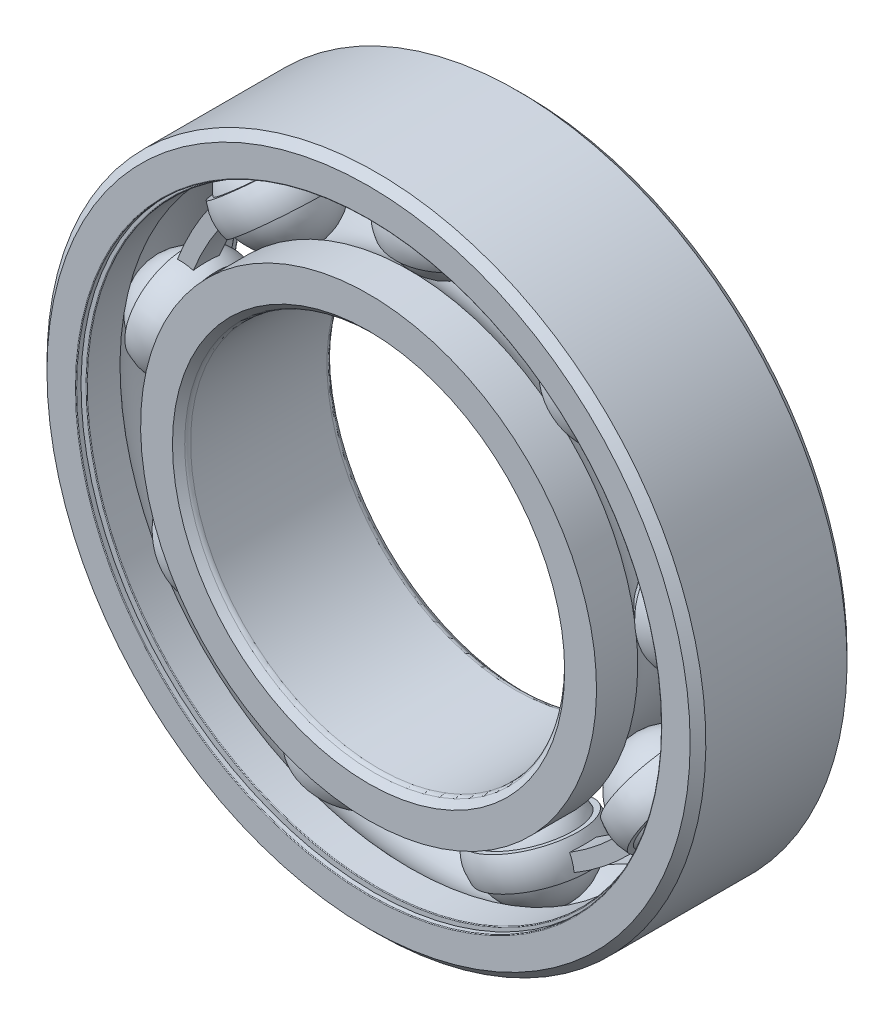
from build123d import *

# Parameters (mm, degrees)
BOSS_EXTRUDE1_DEPTH = 0.416666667
CIRPATTERN1_COUNT   = 9
CIRPATTERN2_COUNT   = 9
FILLET1_R           = 0.0225
FILLET2_R           = 0.1875


with BuildPart() as part:
    # Sketch3 → Revolve1 (revolve)
    with BuildSketch(Plane(origin=(0, 0, 0), x_dir=(0, 0, -1), z_dir=(1, 0, 0)), mode=Mode.PRIVATE) as revolve1_sk:
        with BuildLine():
            Line((2.25, 10.5), (2.5, 10.25))
            Line((2.5, 10.25), (2.5, 9.234615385))
            Line((2.5, 9.234615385), (1.1875, 9.234615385))
            ThreePointArc((1.1875, 9.234615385), (0, 9.7926029), (-1.1875, 9.234615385))
            Line((-1.1875, 9.234615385), (-2.5, 9.234615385))
            Line((-2.5, 9.234615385), (-2.5, 10.25))
            Line((-2.5, 10.25), (-2.25, 10.5))
            Line((-2.25, 10.5), (2.25, 10.5))
        make_face()
    revolve(revolve1_sk.sketch.rotate(Axis((0, 0, 2.5), (0, 0, -1)), 180), axis=Axis((0, 0, 2.5), (0, 0, -1)))

    # Sketch8 → Cut-Revolve1 (revolve, cut)
    with BuildSketch(Plane(origin=(0, 0, 0), x_dir=(0, 0, -1), z_dir=(1, 0, 0)), mode=Mode.PRIVATE) as cut_revolve1_sk:
        Polygon((-2.34, 9.234615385), (-2.25, 9.234615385), (-2.25, 9.656410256), (-2.34, 9.656410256), (-2.34, 9.324615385), (-2.5, 9.324615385), (-2.5, 9.234615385), align=None)
        Polygon((2.25, 9.234615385), (2.34, 9.234615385), (2.5, 9.234615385), (2.5, 9.324615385), (2.34, 9.324615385), (2.34, 9.656410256), (2.25, 9.656410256), align=None)
    revolve(cut_revolve1_sk.sketch.rotate(Axis((0, 0, 2.5), (0, 0, -1)), 180), axis=Axis((0, 0, 2.5), (0, 0, -1)), mode=Mode.SUBTRACT)

    # Fillet1
    fillet1_edges = [part.edges().sort_by_distance(p)[0] for p in [
        (0, 9.324615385, 2.5),
        (0, 9.234615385, 2.25),
        (0, 9.324615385, -2.5),
        (0, 9.234615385, -2.25),
    ]]
    fillet(fillet1_edges, radius=FILLET1_R)


with BuildPart() as body_2:
    # Sketch4 → Revolve2 (revolve)
    with BuildSketch(Plane(origin=(0, 0, 0), x_dir=(0, 0, -1), z_dir=(1, 0, 0)), mode=Mode.PRIVATE) as revolve2_sk:
        with BuildLine():
            Line((-2.25, 6), (-2.5, 6.25))
            Line((-2.5, 6.25), (-2.5, 7.265384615))
            Line((-2.5, 7.265384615), (-1.1875, 7.265384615))
            ThreePointArc((-1.1875, 7.265384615), (0, 6.7073971), (1.1875, 7.265384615))
            Line((1.1875, 7.265384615), (2.5, 7.265384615))
            Line((2.5, 7.265384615), (2.5, 6.25))
            Line((2.5, 6.25), (2.25, 6))
            Line((2.25, 6), (-2.25, 6))
        make_face()
    revolve(revolve2_sk.sketch.rotate(Axis((0, 0, 2.5), (0, 0, -1)), 180), axis=Axis((0, 0, 2.5), (0, 0, -1)))

    # Fillet2
    fillet2_edges = [body_2.edges().sort_by_distance(p)[0] for p in [
        (0, 6, 2.25),
        (0, 6, -2.25),
    ]]
    fillet(fillet2_edges, radius=FILLET2_R)


with BuildPart() as body_3:
    # Sketch5 → Revolve3 (revolve)
    with BuildSketch(Plane(origin=(0, 0, 0), x_dir=(0, 0, -1), z_dir=(1, 0, 0))):
        with BuildLine():
            Line((-1.5426029, 8.25), (1.5426029, 8.25))
            ThreePointArc((1.5426029, 8.25), (0, 9.7926029), (-1.5426029, 8.25))
        make_face()
    revolve(axis=Axis((0, 8.25, 1.5426029), (0, 0, -1)))


with BuildPart() as body_4:
    # Sketch6 → Revolve4 (revolve)
    with BuildSketch(Plane(origin=(0, 0, 0), x_dir=(0, 0, -1), z_dir=(1, 0, 0))):
        with BuildLine():
            Line((-1.461935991, 8.742307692), (-1.634946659, 8.742307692))
            ThreePointArc((-1.634946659, 8.742307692), (-1.721451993, 8.25), (-1.634946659, 7.757692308))
            Line((-1.634946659, 7.757692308), (-1.461935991, 7.757692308))
            ThreePointArc((-1.461935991, 7.757692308), (-1.5426029, 8.25), (-1.461935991, 8.742307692))
        make_face()
    revolve4 = revolve(axis=Axis((0, 10.5, 0), (0, -1, 0)))

    # Sketch7 → Boss-Extrude1 (add, symmetric)
    with BuildSketch(Plane.XY):
        with BuildLine():
            Line((5.30299778, 6.319866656), (5.619447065, 6.696996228))
            ThreePointArc((5.619447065, 6.696996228), (2.99004533, 8.215082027), (0, 8.742307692))
            Line((0, 8.742307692), (0, 8.25))
            ThreePointArc((0, 8.25), (2.821666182, 7.752464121), (5.30299778, 6.319866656))
        make_face()
    boss_extrude1 = extrude(amount=BOSS_EXTRUDE1_DEPTH, both=True)

    # CirPattern2: Revolve4, Boss-Extrude1 ×9 about axis
    cirpattern2_axis = Axis((0, 0, 0), (0, 0, 1))
    add([revolve4.rotate(cirpattern2_axis, i * 360 / CIRPATTERN2_COUNT) for i in range(1, CIRPATTERN2_COUNT)])
    add([boss_extrude1.rotate(cirpattern2_axis, i * 360 / CIRPATTERN2_COUNT) for i in range(1, CIRPATTERN2_COUNT)])


with BuildPart() as cirpattern1_1:
    # CirPattern1: pattern copy
    add(body_3.part.rotate(Axis((0, 0, 0), (0, 0, 1)), 1 * 360 / CIRPATTERN1_COUNT))


with BuildPart() as cirpattern1_2:
    # CirPattern1: pattern copy
    add(body_3.part.rotate(Axis((0, 0, 0), (0, 0, 1)), 2 * 360 / CIRPATTERN1_COUNT))


with BuildPart() as cirpattern1_3:
    # CirPattern1: pattern copy
    add(body_3.part.rotate(Axis((0, 0, 0), (0, 0, 1)), 3 * 360 / CIRPATTERN1_COUNT))


with BuildPart() as cirpattern1_4:
    # CirPattern1: pattern copy
    add(body_3.part.rotate(Axis((0, 0, 0), (0, 0, 1)), 4 * 360 / CIRPATTERN1_COUNT))


with BuildPart() as cirpattern1_5:
    # CirPattern1: pattern copy
    add(body_3.part.rotate(Axis((0, 0, 0), (0, 0, 1)), 5 * 360 / CIRPATTERN1_COUNT))


with BuildPart() as cirpattern1_6:
    # CirPattern1: pattern copy
    add(body_3.part.rotate(Axis((0, 0, 0), (0, 0, 1)), 6 * 360 / CIRPATTERN1_COUNT))


with BuildPart() as cirpattern1_7:
    # CirPattern1: pattern copy
    add(body_3.part.rotate(Axis((0, 0, 0), (0, 0, 1)), 7 * 360 / CIRPATTERN1_COUNT))


with BuildPart() as cirpattern1_8:
    # CirPattern1: pattern copy
    add(body_3.part.rotate(Axis((0, 0, 0), (0, 0, 1)), 8 * 360 / CIRPATTERN1_COUNT))


solid = Compound([part.part, body_2.part, body_3.part, body_4.part, cirpattern1_1.part, cirpattern1_2.part, cirpattern1_3.part, cirpattern1_4.part, cirpattern1_5.part, cirpattern1_6.part, cirpattern1_7.part, cirpattern1_8.part])
